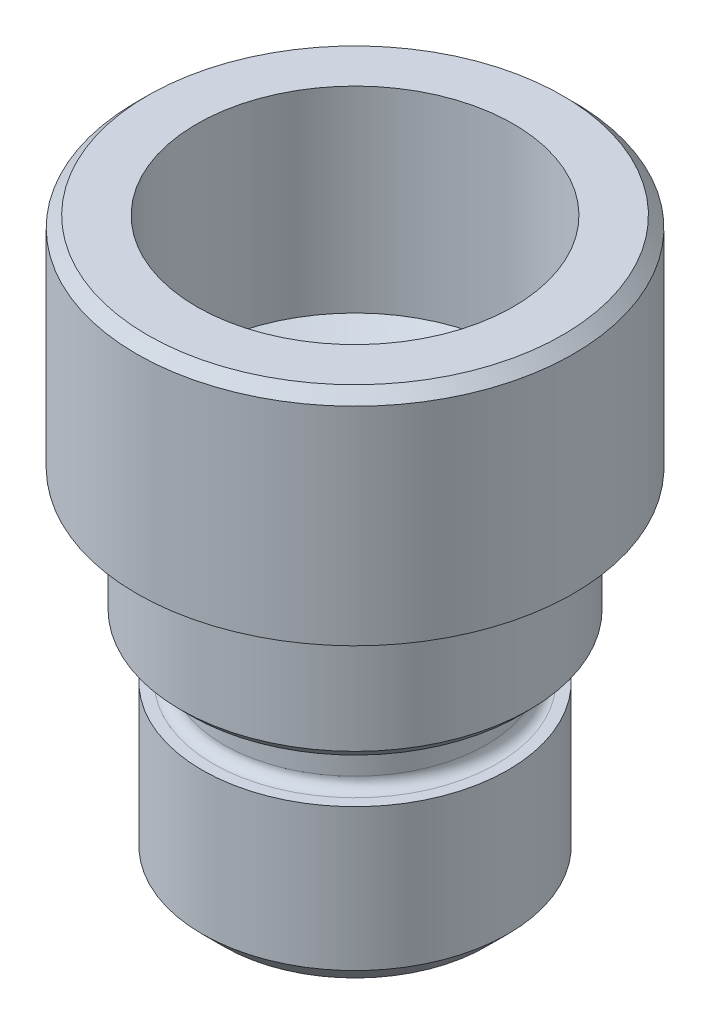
from build123d import *

# Parameters (mm, degrees)
M16X1_5_FORO_FILETTATO_PROFONDO1_D     = 14.5
M16X1_5_FORO_FILETTATO_PROFONDO1_DEPTH = 9
M16X1_5_FORO_FILETTATO_PROFONDO1_TIP   = 4.356239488


with BuildPart() as part:
    # Schizzo1 → Rivoluzione1 (revolve)
    with BuildSketch(Plane(origin=(0, 0, 0), x_dir=(-1, 0, 0), z_dir=(0, 0, -1)), mode=Mode.PRIVATE) as rivoluzione1_sk:
        with BuildLine():
            Line((-6.5, 7.5), (-7, 7.5))
            Line((-7, 7.5), (-7, 1))
            Line((-7, 1), (-6, 0))
            Line((-6, 0), (-5, 0))
            Line((-5, 0), (-5, 17.098709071))
            Line((-5, 17.098709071), (-6.5, 18))
            Line((-6.5, 18), (-6.5, 26))
            Line((-6.5, 26), (-9.5, 26))
            Line((-9.5, 26), (-10, 25.5))
            Line((-10, 25.5), (-10, 16))
            Line((-10, 16), (-8, 16))
            Line((-8, 16), (-8, 10.4))
            Line((-8, 10.4), (-7.5, 9.9))
            Line((-7.5, 9.9), (-6.5, 9.9))
            ThreePointArc((-6.5, 9.9), (-6.146446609, 9.753553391), (-6, 9.4))
            Line((-6, 9.4), (-6, 8))
            ThreePointArc((-6, 8), (-6.146446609, 7.646446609), (-6.5, 7.5))
        make_face()
    revolve(rivoluzione1_sk.sketch.rotate(Axis((0, 0, 0), (0, 1, 0)), 270), axis=Axis((0, 0, 0), (0, 1, 0)))

    # M16x1.5 Foro filettato profondo1
    with Locations(Plane(origin=(0, 26, 0), x_dir=(-1, 0, 0), z_dir=(0, 1, 0))):
        with Locations((0, 0)):
            Hole(M16X1_5_FORO_FILETTATO_PROFONDO1_D / 2, depth=M16X1_5_FORO_FILETTATO_PROFONDO1_DEPTH)
            with Locations((0, 0, -(M16X1_5_FORO_FILETTATO_PROFONDO1_DEPTH + M16X1_5_FORO_FILETTATO_PROFONDO1_TIP / 2))):  # 118° drill point
                Cone(0, M16X1_5_FORO_FILETTATO_PROFONDO1_D / 2, M16X1_5_FORO_FILETTATO_PROFONDO1_TIP, mode=Mode.SUBTRACT)


solid = part.part
